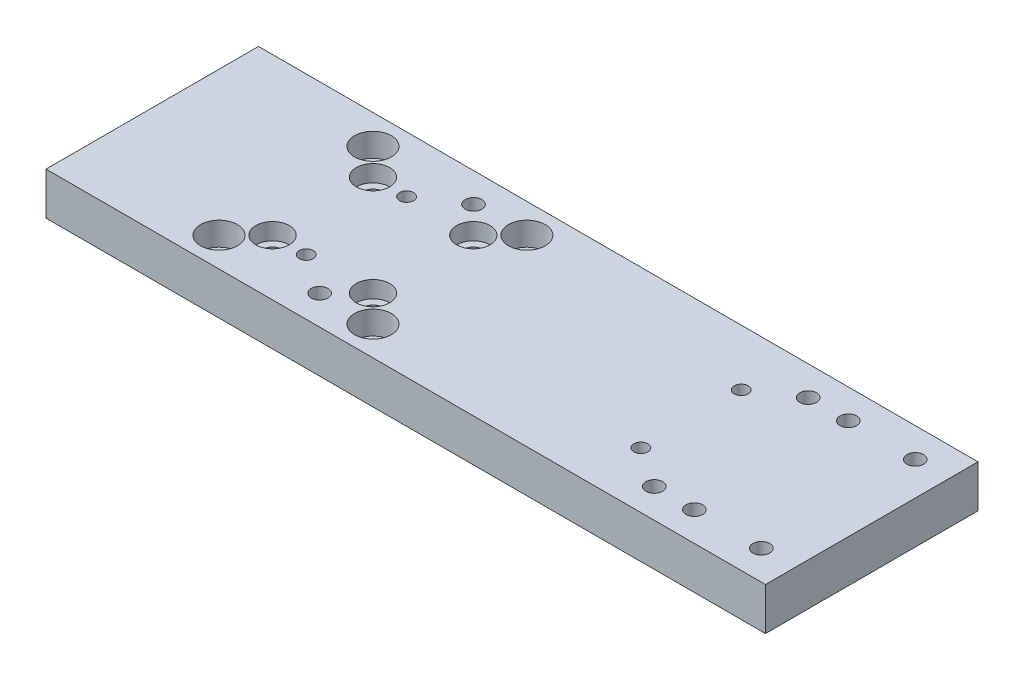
from build123d import *

# Parameters (mm, degrees)
SKETCH1_W                      = 220
SKETCH1_H                      = 63.5
EXTRUDE1_DEPTH                 = 12.7
M5X0_8_TAPPED_HOLE1_D          = 4.2
CBORE_FOR_M5_SHCS1_D           = 5.5
CBORE_FOR_M5_SHCS1_CBORE_D     = 10
CBORE_FOR_M5_SHCS1_CBORE_DEPTH = 5
CBORE_FOR_M6_SHCS2_D           = 6.6
CBORE_FOR_M6_SHCS2_CBORE_D     = 11
CBORE_FOR_M6_SHCS2_CBORE_DEPTH = 7
M6X1_0_TAPPED_HOLE1_D          = 5
MOVE_FACE1_BY                  = 5


with BuildPart() as part:
    # Sketch1 → Extrude1 (new body)
    with BuildSketch(Plane(origin=(0, 0, 0), x_dir=(1, 0, 0), z_dir=(0, 1, 0))):
        with Locations((110, 31.75)):
            Rectangle(SKETCH1_W, SKETCH1_H)
    extrude(amount=EXTRUDE1_DEPTH)

    # M5x0.8 Tapped Hole1 (through all)
    with Locations(Plane(origin=(161, 12.7, -16.75), x_dir=(0, 0, 1), z_dir=(0, 1, 0))):
        with Locations((0, 0), (-30, 0), (-30, -100), (0, -100)):
            Hole(M5X0_8_TAPPED_HOLE1_D / 2)

    # CBORE for M5 SHCS1 (through all)
    with Locations(Plane(origin=(0, 12.7, 0), x_dir=(-1, 0, 0), z_dir=(0, 1, 0))):
        with Locations((-80.95, -46.75), (-80.95, -16.75), (-50.95, -16.75), (-50.95, -46.75)):
            CounterBoreHole(CBORE_FOR_M5_SHCS1_D / 2, CBORE_FOR_M5_SHCS1_CBORE_D / 2, CBORE_FOR_M5_SHCS1_CBORE_DEPTH)

    # CBORE for M6 SHCS2 (through all)
    with Locations(Plane(origin=(0, 12.7, 0), x_dir=(1, 0, 0), z_dir=(0, 1, 0))):
        with Locations((88.95, 8.75), (88.95, 54.75), (42.95, 54.75), (42.95, 8.75)):
            CounterBoreHole(CBORE_FOR_M6_SHCS2_D / 2, CBORE_FOR_M6_SHCS2_CBORE_D / 2, CBORE_FOR_M6_SHCS2_CBORE_DEPTH)

    # M6x1.0 Tapped Hole1 (through all)
    with Locations(Plane(origin=(0, 12.7, 0), x_dir=(1, 0, 0), z_dir=(0, 1, 0))):
        with Locations((173, 54.75), (173, 8.75), (73, 8.75), (73, 54.75), (205, 8.75), (205, 54.75), (185, 54.75), (185, 8.75)):
            Hole(M6X1_0_TAPPED_HOLE1_D / 2)

    # Move Face1: a face moved inward by 5.0
    extrude(part.faces().sort_by_distance((220, 6.35, -31.75))[0], amount=MOVE_FACE1_BY, dir=(-1, 0, 0), mode=Mode.SUBTRACT)


solid = part.part
